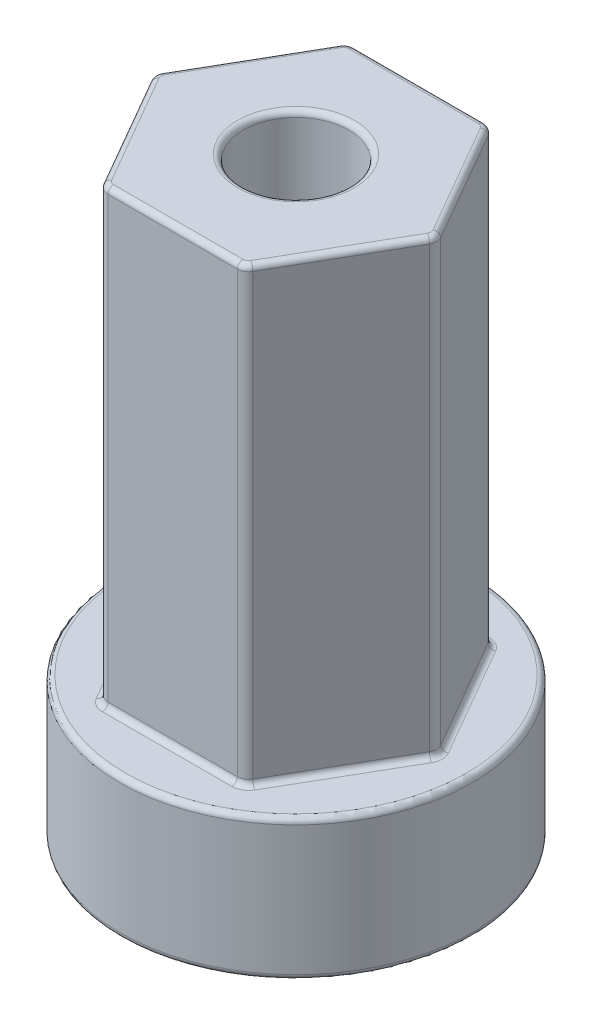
from build123d import *

# Parameters (mm, degrees)
SKETCH1_R          = 7.9375
EXTRUDE1_DEPTH     = 6.35
EXTRUDE2_DEPTH     = 20.32
SKETCH3_R          = 2.38125
CUT_EXTRUDE1_DEPTH = 29.936079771
FILLET1_R          = 0.508
FILLET2_R          = 0.254


with BuildPart() as part:
    # Sketch1 → Extrude1 (new body)
    with BuildSketch(Plane(origin=(0, 0, 0), x_dir=(1, 0, 0), z_dir=(0, 1, 0))):
        with Locations(Location((0, 0, 0), (0, 0, 270))):
            Circle(SKETCH1_R)
    extrude(amount=EXTRUDE1_DEPTH)

    # Sketch2 → Extrude2 (add)
    with BuildSketch(Plane(origin=(0, 6.35, 0), x_dir=(-1, 0, 0), z_dir=(0, 1, 0))):
        Polygon((6.415804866, 0), (3.207902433, 5.55625), (-3.207902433, 5.55625), (-6.415804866, 0), (-3.207902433, -5.55625), (3.207902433, -5.55625), align=None)
    extrude(amount=EXTRUDE2_DEPTH)

    # Sketch3 → Cut-Extrude1 (cut, through all)
    with BuildSketch(Plane(origin=(0, 26.67, 0), x_dir=(-1, 0, 0), z_dir=(0, 1, 0))):
        with Locations(Location((0, 0, 0), (0, 0, 90))):
            Circle(SKETCH3_R)
    extrude(amount=-CUT_EXTRUDE1_DEPTH, mode=Mode.SUBTRACT)

    # Fillet1
    fillet1_edges = [part.edges().sort_by_distance(p)[0] for p in [
        (6.415804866, 16.51, 0),
        (3.207902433, 16.51, -5.55625),
        (-3.207902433, 16.51, -5.55625),
        (-6.415804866, 16.51, 0),
        (-3.207902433, 16.51, 5.55625),
        (3.207902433, 16.51, 5.55625),
    ]]
    fillet(fillet1_edges, radius=FILLET1_R)

    # Fillet2
    fillet2_edges = [part.edges().sort_by_distance(p)[0] for p in [
        (0, 0, -7.9375),
        (0, 0, -2.38125),
        (0, 26.67, -2.38125),
        (-4.81185365, 6.35, -2.778125),
        (-4.81185365, 26.67, -2.778125),
        (0, 6.35, -5.55625),
        (0, 26.67, -5.55625),
        (-4.81185365, 26.67, 2.778125),
        (0, 26.67, 5.55625),
        (4.81185365, 26.67, 2.778125),
        (4.81185365, 26.67, -2.778125),
        (-6.337216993, 26.67, 0),
        (-3.168608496, 26.67, 5.488190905),
        (3.168608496, 26.67, 5.488190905),
        (6.337216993, 26.67, 0),
        (3.168608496, 26.67, -5.488190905),
        (-3.168608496, 26.67, -5.488190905),
        (4.81185365, 6.35, -2.778125),
        (4.81185365, 6.35, 2.778125),
        (0, 6.35, -7.9375),
        (0, 6.35, 5.55625),
        (-4.81185365, 6.35, 2.778125),
        (-3.168608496, 6.35, -5.488190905),
        (3.168608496, 6.35, -5.488190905),
        (6.337216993, 6.35, 0),
        (3.168608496, 6.35, 5.488190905),
        (-3.168608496, 6.35, 5.488190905),
        (-6.337216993, 6.35, 0),
    ]]
    fillet(fillet2_edges, radius=FILLET2_R)


solid = part.part
